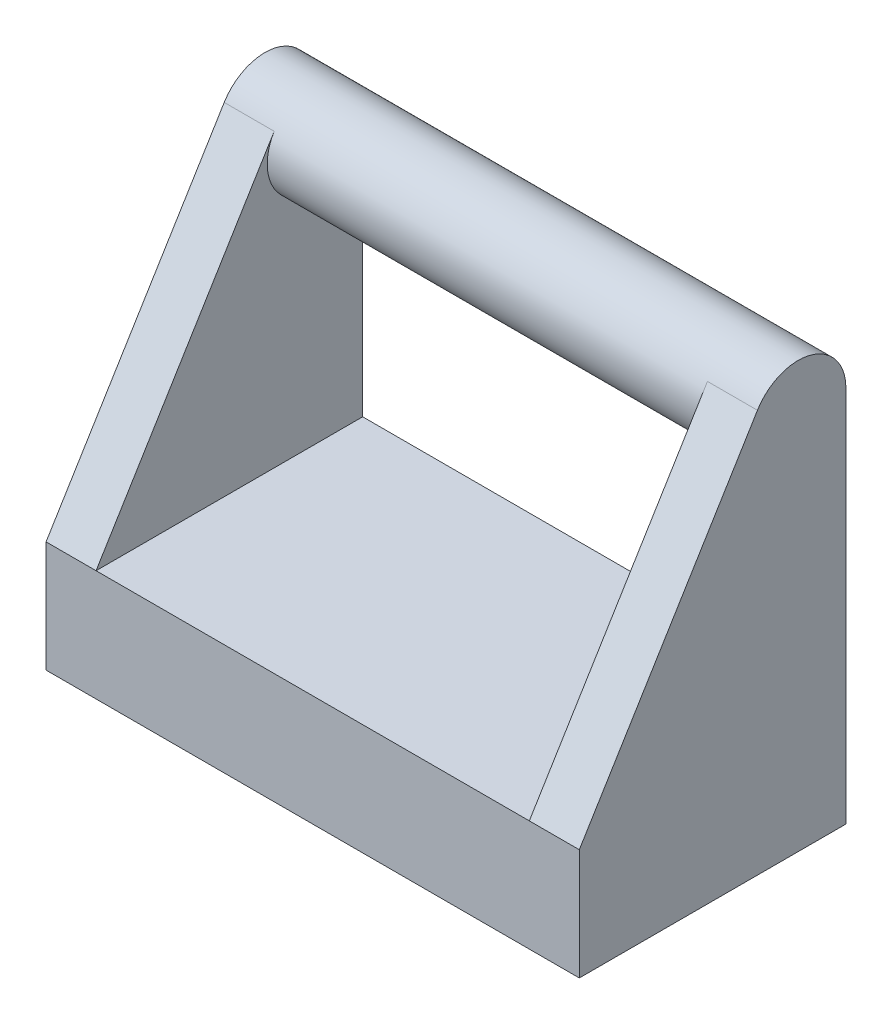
from build123d import *

# Parameters (mm, degrees)
ESBO_O2_W                = 16
ESBO_O2_H                = 8
RESSALTO_EXTRUS_O1_DEPTH = 3.333333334
ESBO_O3_R                = 1.432525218
RESSALTO_EXTRUS_O2_DEPTH = 1.5
ESBO_O4_R                = 1.432525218
RESSALTO_EXTRUS_O3_DEPTH = 16
ESBO_O6_W                = 14
ESBO_O6_H                = 6
CORTE_EXTRUS_O1_DEPTH    = 2.333334
ESBO_O7_R                = 1.5
ESBO_O7_R_2              = 0.75
RESSALTO_EXTRUS_O4_DEPTH = 2.333334


with BuildPart() as part:
    # Esbo_o2 → Ressalto-extrus_o1 (new body)
    with BuildSketch(Plane(origin=(0, 0, 0), x_dir=(1, 0, 0), z_dir=(0, 1, 0))):
        with Locations((-8, 4)):
            Rectangle(ESBO_O2_W, ESBO_O2_H)
    extrude(amount=RESSALTO_EXTRUS_O1_DEPTH)

    # Esbo_o3 → Ressalto-extrus_o2 (add)
    with BuildSketch(Plane(origin=(0, 0, 0), x_dir=(0, 0, -1), z_dir=(1, 0, 0))):
        with BuildLine():
            Line((5.345111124, 12.080297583), (0, 3.333333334))
            Line((0, 3.333333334), (8, 3.333333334))
            Line((8, 3.333333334), (8, 11.333333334))
            ThreePointArc((8, 11.333333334), (6.179491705, 9.954349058), (5.345111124, 12.080297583))
        make_face()
        with Locations((6.567474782, 11.333333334)):
            Circle(ESBO_O3_R)
    ressalto_extrus_o2 = extrude(amount=-RESSALTO_EXTRUS_O2_DEPTH)

    # Espelhar1: Ressalto-extrus_o2 across plane
    add(ressalto_extrus_o2.mirror(Plane.ZY.offset(8)))

    # Esbo_o4 → Ressalto-extrus_o3 (add)
    with BuildSketch(Plane.ZY.offset(16)):
        with Locations(Location((-6.567474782, 11.333333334, 0), (0, 0, 180))):
            Circle(ESBO_O4_R)
    extrude(amount=-RESSALTO_EXTRUS_O3_DEPTH)

    # Esbo_o6 → Corte-extrus_o1 (cut)
    with BuildSketch(Plane.XZ):
        with Locations((-8, -4)):
            Rectangle(ESBO_O6_W, ESBO_O6_H)
    extrude(amount=-CORTE_EXTRUS_O1_DEPTH, mode=Mode.SUBTRACT)

    # Esbo_o7 → Ressalto-extrus_o4 (add)
    with BuildSketch(Plane.XZ.offset(-2.333334)):
        with Locations(Location((-8, -4, 0), (0, 0, 270))):
            Circle(ESBO_O7_R)
        with Locations(Location((-8, -4, 0), (0, 0, 270))):
            Circle(ESBO_O7_R_2, mode=Mode.SUBTRACT)
    extrude(amount=RESSALTO_EXTRUS_O4_DEPTH)


solid = part.part
